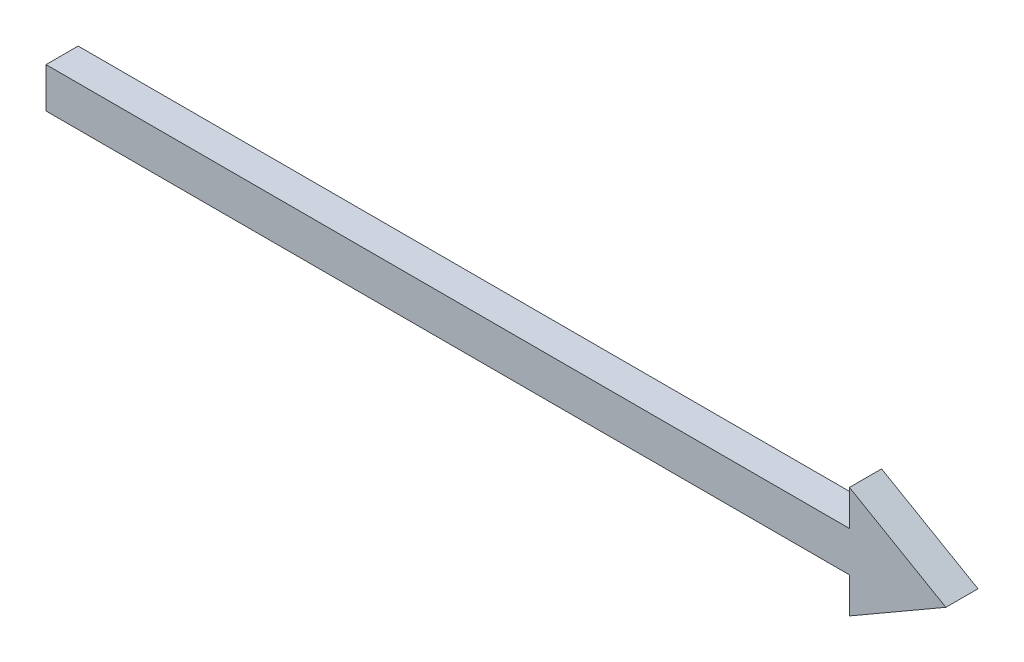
ISO-10303-21;
HEADER;
FILE_DESCRIPTION(('STEP AP214'),'2;1');
FILE_NAME('part.step','',(''),(''),'','','');
FILE_SCHEMA(('AUTOMOTIVE_DESIGN { 1 0 10303 214 1 1 1 1 }'));
ENDSEC;
DATA;
#1=APPLICATION_CONTEXT('core data for automotive mechanical design processes');
#2=APPLICATION_PROTOCOL_DEFINITION('international standard','automotive_design',2000,#1);
#3=PRODUCT_CONTEXT('',#1,'mechanical');
#4=PRODUCT('Part','Part','',(#3));
#5=PRODUCT_RELATED_PRODUCT_CATEGORY('part','',(#4));
#6=PRODUCT_DEFINITION_FORMATION('','',#4);
#7=PRODUCT_DEFINITION_CONTEXT('part definition',#1,'design');
#8=PRODUCT_DEFINITION('design','',#6,#7);
#9=PRODUCT_DEFINITION_SHAPE('','',#8);
#10=(LENGTH_UNIT() NAMED_UNIT(*) SI_UNIT(.MILLI.,.METRE.));
#11=(NAMED_UNIT(*) PLANE_ANGLE_UNIT() SI_UNIT($,.RADIAN.));
#12=(NAMED_UNIT(*) SI_UNIT($,.STERADIAN.) SOLID_ANGLE_UNIT());
#13=UNCERTAINTY_MEASURE_WITH_UNIT(LENGTH_MEASURE(1.E-05),#10,'distance_accuracy_value','');
#14=(GEOMETRIC_REPRESENTATION_CONTEXT(3) GLOBAL_UNCERTAINTY_ASSIGNED_CONTEXT((#13)) GLOBAL_UNIT_ASSIGNED_CONTEXT((#10,
#11,#12)) REPRESENTATION_CONTEXT('',''));
#15=CARTESIAN_POINT('',(0.,0.,0.));
#16=DIRECTION('',(0.,0.,1.));
#17=DIRECTION('',(1.,0.,0.));
#18=AXIS2_PLACEMENT_3D('',#15,#16,#17);
#19=CARTESIAN_POINT('',(192.,0.,2.));
#20=DIRECTION('',(-0.500000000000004,0.866025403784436,0.));
#21=DIRECTION('',(-0.866025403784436,-0.500000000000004,0.));
#22=AXIS2_PLACEMENT_3D('',#19,#20,#21);
#23=PLANE('',#22);
#24=DIRECTION('',(0.866025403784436,0.500000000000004,0.));
#25=VECTOR('',#24,1.);
#26=CARTESIAN_POINT('',(192.,0.,-2.));
#27=LINE('',#26,#25);
#28=CARTESIAN_POINT('',(180.,-6.92820323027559,-2.));
#29=VERTEX_POINT('',#28);
#30=CARTESIAN_POINT('',(192.,0.,-2.));
#31=VERTEX_POINT('',#30);
#32=EDGE_CURVE('E120',#29,#31,#27,.T.);
#33=ORIENTED_EDGE('',*,*,#32,.T.);
#34=DIRECTION('',(0.,0.,-1.));
#35=VECTOR('',#34,1.);
#36=CARTESIAN_POINT('',(192.,0.,2.));
#37=LINE('',#36,#35);
#38=CARTESIAN_POINT('',(192.,0.,2.));
#39=VERTEX_POINT('',#38);
#40=EDGE_CURVE('E11',#39,#31,#37,.T.);
#41=ORIENTED_EDGE('',*,*,#40,.F.);
#42=DIRECTION('',(0.866025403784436,0.500000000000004,0.));
#43=VECTOR('',#42,1.);
#44=CARTESIAN_POINT('',(192.,0.,2.));
#45=LINE('',#44,#43);
#46=CARTESIAN_POINT('',(180.,-6.92820323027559,2.));
#47=VERTEX_POINT('',#46);
#48=EDGE_CURVE('E132',#47,#39,#45,.T.);
#49=ORIENTED_EDGE('',*,*,#48,.F.);
#50=DIRECTION('',(0.,0.,-1.));
#51=VECTOR('',#50,1.);
#52=CARTESIAN_POINT('',(180.,-6.92820323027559,2.));
#53=LINE('',#52,#51);
#54=EDGE_CURVE('E116',#47,#29,#53,.T.);
#55=ORIENTED_EDGE('',*,*,#54,.T.);
#56=EDGE_LOOP('',(#33,#41,#49,#55));
#57=FACE_BOUND('',#56,.T.);
#58=ADVANCED_FACE('F30',(#57),#23,.F.);
#59=CARTESIAN_POINT('',(180.,6.92820323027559,2.));
#60=DIRECTION('',(-0.500000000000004,-0.866025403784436,0.));
#61=DIRECTION('',(0.866025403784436,-0.500000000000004,0.));
#62=AXIS2_PLACEMENT_3D('',#59,#60,#61);
#63=PLANE('',#62);
#64=DIRECTION('',(-0.866025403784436,0.500000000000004,0.));
#65=VECTOR('',#64,1.);
#66=CARTESIAN_POINT('',(180.,6.92820323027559,-2.));
#67=LINE('',#66,#65);
#68=CARTESIAN_POINT('',(180.,6.92820323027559,-2.));
#69=VERTEX_POINT('',#68);
#70=EDGE_CURVE('E123',#31,#69,#67,.T.);
#71=ORIENTED_EDGE('',*,*,#70,.T.);
#72=DIRECTION('',(0.,0.,-1.));
#73=VECTOR('',#72,1.);
#74=CARTESIAN_POINT('',(180.,6.92820323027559,2.));
#75=LINE('',#74,#73);
#76=CARTESIAN_POINT('',(180.,6.92820323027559,2.));
#77=VERTEX_POINT('',#76);
#78=EDGE_CURVE('E38',#77,#69,#75,.T.);
#79=ORIENTED_EDGE('',*,*,#78,.F.);
#80=DIRECTION('',(-0.866025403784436,0.500000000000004,0.));
#81=VECTOR('',#80,1.);
#82=CARTESIAN_POINT('',(180.,6.92820323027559,2.));
#83=LINE('',#82,#81);
#84=EDGE_CURVE('E86',#39,#77,#83,.T.);
#85=ORIENTED_EDGE('',*,*,#84,.F.);
#86=ORIENTED_EDGE('',*,*,#40,.T.);
#87=EDGE_LOOP('',(#71,#79,#85,#86));
#88=FACE_BOUND('',#87,.T.);
#89=ADVANCED_FACE('F157',(#88),#63,.F.);
#90=CARTESIAN_POINT('',(180.,2.5,2.));
#91=DIRECTION('',(1.,0.,0.));
#92=DIRECTION('',(0.,0.,-1.));
#93=AXIS2_PLACEMENT_3D('',#90,#91,#92);
#94=PLANE('',#93);
#95=DIRECTION('',(0.,-1.,0.));
#96=VECTOR('',#95,1.);
#97=CARTESIAN_POINT('',(180.,2.5,-2.));
#98=LINE('',#97,#96);
#99=CARTESIAN_POINT('',(180.,2.5,-2.));
#100=VERTEX_POINT('',#99);
#101=EDGE_CURVE('E125',#69,#100,#98,.T.);
#102=ORIENTED_EDGE('',*,*,#101,.T.);
#103=DIRECTION('',(0.,0.,-1.));
#104=VECTOR('',#103,1.);
#105=CARTESIAN_POINT('',(180.,2.5,2.));
#106=LINE('',#105,#104);
#107=CARTESIAN_POINT('',(180.,2.5,2.));
#108=VERTEX_POINT('',#107);
#109=EDGE_CURVE('E136',#108,#100,#106,.T.);
#110=ORIENTED_EDGE('',*,*,#109,.F.);
#111=DIRECTION('',(0.,-1.,0.));
#112=VECTOR('',#111,1.);
#113=CARTESIAN_POINT('',(180.,2.5,2.));
#114=LINE('',#113,#112);
#115=EDGE_CURVE('E144',#77,#108,#114,.T.);
#116=ORIENTED_EDGE('',*,*,#115,.F.);
#117=ORIENTED_EDGE('',*,*,#78,.T.);
#118=EDGE_LOOP('',(#102,#110,#116,#117));
#119=FACE_BOUND('',#118,.T.);
#120=ADVANCED_FACE('F142',(#119),#94,.F.);
#121=CARTESIAN_POINT('',(80.,2.5,2.));
#122=DIRECTION('',(0.,-1.,0.));
#123=DIRECTION('',(0.,0.,-1.));
#124=AXIS2_PLACEMENT_3D('',#121,#122,#123);
#125=PLANE('',#124);
#126=DIRECTION('',(-1.,0.,0.));
#127=VECTOR('',#126,1.);
#128=CARTESIAN_POINT('',(80.,2.5,-2.));
#129=LINE('',#128,#127);
#130=CARTESIAN_POINT('',(80.,2.5,-2.));
#131=VERTEX_POINT('',#130);
#132=EDGE_CURVE('E127',#100,#131,#129,.T.);
#133=ORIENTED_EDGE('',*,*,#132,.T.);
#134=DIRECTION('',(0.,0.,-1.));
#135=VECTOR('',#134,1.);
#136=CARTESIAN_POINT('',(80.,2.5,2.));
#137=LINE('',#136,#135);
#138=CARTESIAN_POINT('',(80.,2.5,2.));
#139=VERTEX_POINT('',#138);
#140=EDGE_CURVE('E111',#139,#131,#137,.T.);
#141=ORIENTED_EDGE('',*,*,#140,.F.);
#142=DIRECTION('',(-1.,0.,0.));
#143=VECTOR('',#142,1.);
#144=CARTESIAN_POINT('',(80.,2.5,2.));
#145=LINE('',#144,#143);
#146=EDGE_CURVE('E102',#108,#139,#145,.T.);
#147=ORIENTED_EDGE('',*,*,#146,.F.);
#148=ORIENTED_EDGE('',*,*,#109,.T.);
#149=EDGE_LOOP('',(#133,#141,#147,#148));
#150=FACE_BOUND('',#149,.T.);
#151=ADVANCED_FACE('F150',(#150),#125,.F.);
#152=CARTESIAN_POINT('',(80.,2.5,2.));
#153=DIRECTION('',(1.,0.,0.));
#154=DIRECTION('',(0.,0.,-1.));
#155=AXIS2_PLACEMENT_3D('',#152,#153,#154);
#156=PLANE('',#155);
#157=DIRECTION('',(0.,-1.,0.));
#158=VECTOR('',#157,1.);
#159=CARTESIAN_POINT('',(80.,2.5,-2.));
#160=LINE('',#159,#158);
#161=CARTESIAN_POINT('',(80.,-2.5,-2.));
#162=VERTEX_POINT('',#161);
#163=EDGE_CURVE('E110',#131,#162,#160,.T.);
#164=ORIENTED_EDGE('',*,*,#163,.T.);
#165=DIRECTION('',(0.,0.,-1.));
#166=VECTOR('',#165,1.);
#167=CARTESIAN_POINT('',(80.,-2.5,2.));
#168=LINE('',#167,#166);
#169=CARTESIAN_POINT('',(80.,-2.5,2.));
#170=VERTEX_POINT('',#169);
#171=EDGE_CURVE('E107',#170,#162,#168,.T.);
#172=ORIENTED_EDGE('',*,*,#171,.F.);
#173=DIRECTION('',(0.,-1.,0.));
#174=VECTOR('',#173,1.);
#175=CARTESIAN_POINT('',(80.,2.5,2.));
#176=LINE('',#175,#174);
#177=EDGE_CURVE('E96',#139,#170,#176,.T.);
#178=ORIENTED_EDGE('',*,*,#177,.F.);
#179=ORIENTED_EDGE('',*,*,#140,.T.);
#180=EDGE_LOOP('',(#164,#172,#178,#179));
#181=FACE_BOUND('',#180,.T.);
#182=ADVANCED_FACE('F108',(#181),#156,.F.);
#183=CARTESIAN_POINT('',(80.,-2.5,2.));
#184=DIRECTION('',(0.,1.,0.));
#185=DIRECTION('',(0.,0.,1.));
#186=AXIS2_PLACEMENT_3D('',#183,#184,#185);
#187=PLANE('',#186);
#188=DIRECTION('',(1.,0.,0.));
#189=VECTOR('',#188,1.);
#190=CARTESIAN_POINT('',(80.,-2.5,-2.));
#191=LINE('',#190,#189);
#192=CARTESIAN_POINT('',(180.,-2.5,-2.));
#193=VERTEX_POINT('',#192);
#194=EDGE_CURVE('E72',#162,#193,#191,.T.);
#195=ORIENTED_EDGE('',*,*,#194,.T.);
#196=DIRECTION('',(0.,0.,-1.));
#197=VECTOR('',#196,1.);
#198=CARTESIAN_POINT('',(180.,-2.5,2.));
#199=LINE('',#198,#197);
#200=CARTESIAN_POINT('',(180.,-2.5,2.));
#201=VERTEX_POINT('',#200);
#202=EDGE_CURVE('E112',#201,#193,#199,.T.);
#203=ORIENTED_EDGE('',*,*,#202,.F.);
#204=DIRECTION('',(1.,0.,0.));
#205=VECTOR('',#204,1.);
#206=CARTESIAN_POINT('',(80.,-2.5,2.));
#207=LINE('',#206,#205);
#208=EDGE_CURVE('E100',#170,#201,#207,.T.);
#209=ORIENTED_EDGE('',*,*,#208,.F.);
#210=ORIENTED_EDGE('',*,*,#171,.T.);
#211=EDGE_LOOP('',(#195,#203,#209,#210));
#212=FACE_BOUND('',#211,.T.);
#213=ADVANCED_FACE('F114',(#212),#187,.F.);
#214=CARTESIAN_POINT('',(180.,-6.92820323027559,2.));
#215=DIRECTION('',(1.,0.,0.));
#216=DIRECTION('',(0.,0.,-1.));
#217=AXIS2_PLACEMENT_3D('',#214,#215,#216);
#218=PLANE('',#217);
#219=DIRECTION('',(0.,-1.,0.));
#220=VECTOR('',#219,1.);
#221=CARTESIAN_POINT('',(180.,-6.92820323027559,-2.));
#222=LINE('',#221,#220);
#223=EDGE_CURVE('E78',#193,#29,#222,.T.);
#224=ORIENTED_EDGE('',*,*,#223,.T.);
#225=ORIENTED_EDGE('',*,*,#54,.F.);
#226=DIRECTION('',(0.,-1.,0.));
#227=VECTOR('',#226,1.);
#228=CARTESIAN_POINT('',(180.,-6.92820323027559,2.));
#229=LINE('',#228,#227);
#230=EDGE_CURVE('E46',#201,#47,#229,.T.);
#231=ORIENTED_EDGE('',*,*,#230,.F.);
#232=ORIENTED_EDGE('',*,*,#202,.T.);
#233=EDGE_LOOP('',(#224,#225,#231,#232));
#234=FACE_BOUND('',#233,.T.);
#235=ADVANCED_FACE('F171',(#234),#218,.F.);
#236=CARTESIAN_POINT('',(180.,-6.92820323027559,2.));
#237=DIRECTION('',(0.,0.,-1.));
#238=DIRECTION('',(-1.,0.,0.));
#239=AXIS2_PLACEMENT_3D('',#236,#237,#238);
#240=PLANE('',#239);
#241=ORIENTED_EDGE('',*,*,#48,.T.);
#242=ORIENTED_EDGE('',*,*,#84,.T.);
#243=ORIENTED_EDGE('',*,*,#115,.T.);
#244=ORIENTED_EDGE('',*,*,#146,.T.);
#245=ORIENTED_EDGE('',*,*,#177,.T.);
#246=ORIENTED_EDGE('',*,*,#208,.T.);
#247=ORIENTED_EDGE('',*,*,#230,.T.);
#248=EDGE_LOOP('',(#241,#242,#243,#244,#245,#246,#247));
#249=FACE_BOUND('',#248,.T.);
#250=ADVANCED_FACE('F98',(#249),#240,.F.);
#251=CARTESIAN_POINT('',(180.,-6.92820323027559,-2.));
#252=DIRECTION('',(0.,0.,-1.));
#253=DIRECTION('',(-1.,0.,0.));
#254=AXIS2_PLACEMENT_3D('',#251,#252,#253);
#255=PLANE('',#254);
#256=ORIENTED_EDGE('',*,*,#32,.F.);
#257=ORIENTED_EDGE('',*,*,#223,.F.);
#258=ORIENTED_EDGE('',*,*,#194,.F.);
#259=ORIENTED_EDGE('',*,*,#163,.F.);
#260=ORIENTED_EDGE('',*,*,#132,.F.);
#261=ORIENTED_EDGE('',*,*,#101,.F.);
#262=ORIENTED_EDGE('',*,*,#70,.F.);
#263=EDGE_LOOP('',(#256,#257,#258,#259,#260,#261,#262));
#264=FACE_BOUND('',#263,.T.);
#265=ADVANCED_FACE('F148',(#264),#255,.T.);
#266=CLOSED_SHELL('',(#58,#89,#120,#151,#182,#213,#235,#250,#265));
#267=MANIFOLD_SOLID_BREP('B2',#266);
#268=ADVANCED_BREP_SHAPE_REPRESENTATION('',(#18,#267),#14);
#269=SHAPE_DEFINITION_REPRESENTATION(#9,#268);
ENDSEC;
END-ISO-10303-21;
